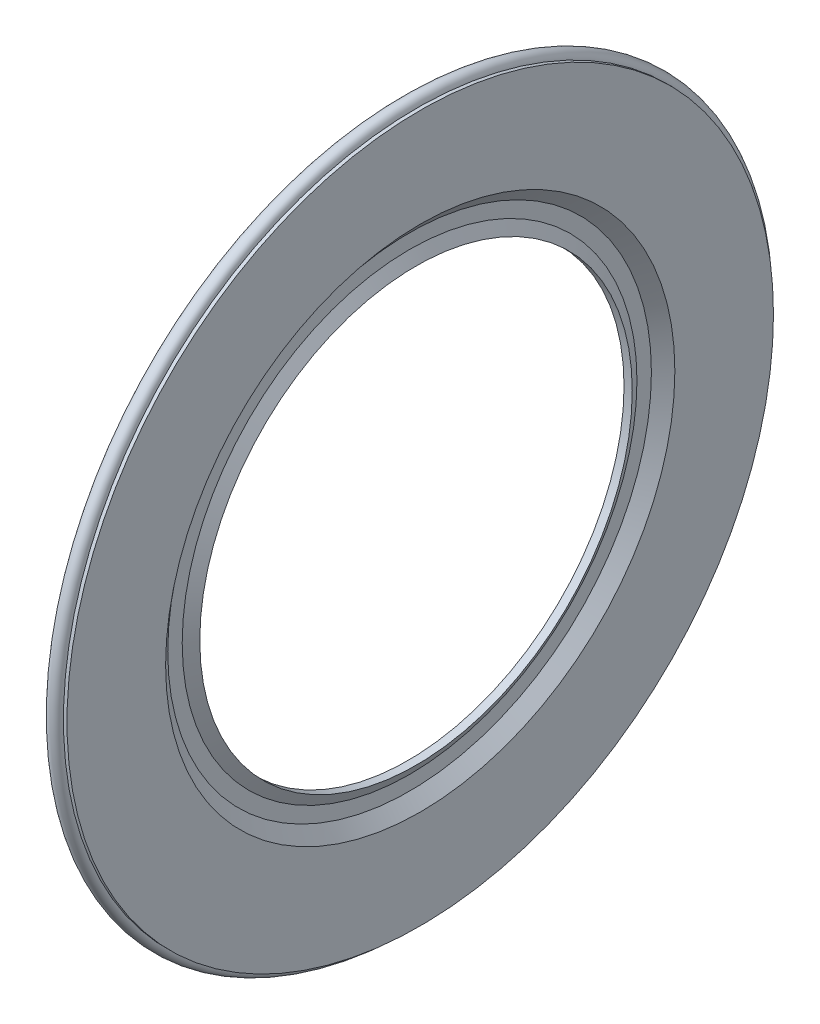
ISO-10303-21;
HEADER;
FILE_DESCRIPTION(('STEP AP214'),'2;1');
FILE_NAME('part.step','',(''),(''),'','','');
FILE_SCHEMA(('AUTOMOTIVE_DESIGN { 1 0 10303 214 1 1 1 1 }'));
ENDSEC;
DATA;
#1=APPLICATION_CONTEXT('core data for automotive mechanical design processes');
#2=APPLICATION_PROTOCOL_DEFINITION('international standard','automotive_design',2000,#1);
#3=PRODUCT_CONTEXT('',#1,'mechanical');
#4=PRODUCT('Part','Part','',(#3));
#5=PRODUCT_RELATED_PRODUCT_CATEGORY('part','',(#4));
#6=PRODUCT_DEFINITION_FORMATION('','',#4);
#7=PRODUCT_DEFINITION_CONTEXT('part definition',#1,'design');
#8=PRODUCT_DEFINITION('design','',#6,#7);
#9=PRODUCT_DEFINITION_SHAPE('','',#8);
#10=(LENGTH_UNIT() NAMED_UNIT(*) SI_UNIT(.MILLI.,.METRE.));
#11=(NAMED_UNIT(*) PLANE_ANGLE_UNIT() SI_UNIT($,.RADIAN.));
#12=(NAMED_UNIT(*) SI_UNIT($,.STERADIAN.) SOLID_ANGLE_UNIT());
#13=UNCERTAINTY_MEASURE_WITH_UNIT(LENGTH_MEASURE(1.E-05),#10,'distance_accuracy_value','');
#14=(GEOMETRIC_REPRESENTATION_CONTEXT(3) GLOBAL_UNCERTAINTY_ASSIGNED_CONTEXT((#13)) GLOBAL_UNIT_ASSIGNED_CONTEXT((#10,
#11,#12)) REPRESENTATION_CONTEXT('',''));
#15=CARTESIAN_POINT('',(0.,0.,0.));
#16=DIRECTION('',(0.,0.,1.));
#17=DIRECTION('',(1.,0.,0.));
#18=AXIS2_PLACEMENT_3D('',#15,#16,#17);
#19=CARTESIAN_POINT('',(5.5,0.,0.));
#20=DIRECTION('',(-1.,0.,0.));
#21=DIRECTION('',(0.,0.,1.));
#22=AXIS2_PLACEMENT_3D('',#19,#20,#21);
#23=CONICAL_SURFACE('',#22,6.34641016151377,1.0471975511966);
#24=CARTESIAN_POINT('',(5.6501110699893,0.,0.));
#25=DIRECTION('',(1.,0.,0.));
#26=DIRECTION('',(0.,0.,-1.));
#27=AXIS2_PLACEMENT_3D('',#24,#25,#26);
#28=CIRCLE('',#27,6.08641016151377);
#29=CARTESIAN_POINT('',(5.6501110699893,0.,-6.08641016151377));
#30=VERTEX_POINT('',#29);
#31=EDGE_CURVE('E76',#30,#30,#28,.T.);
#32=ORIENTED_EDGE('',*,*,#31,.T.);
#33=EDGE_LOOP('',(#32));
#34=FACE_BOUND('',#33,.T.);
#35=CARTESIAN_POINT('',(5.5,0.,0.));
#36=DIRECTION('',(1.,0.,0.));
#37=DIRECTION('',(0.,0.,-1.));
#38=AXIS2_PLACEMENT_3D('',#35,#36,#37);
#39=CIRCLE('',#38,6.34641016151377);
#40=CARTESIAN_POINT('',(5.5,0.,-6.34641016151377));
#41=VERTEX_POINT('',#40);
#42=EDGE_CURVE('E10',#41,#41,#39,.T.);
#43=ORIENTED_EDGE('',*,*,#42,.F.);
#44=EDGE_LOOP('',(#43));
#45=FACE_BOUND('',#44,.T.);
#46=ADVANCED_FACE('F15',(#34,#45),#23,.F.);
#47=CARTESIAN_POINT('',(5.5,7.16,0.));
#48=DIRECTION('',(-1.,0.,0.));
#49=DIRECTION('',(0.,0.,1.));
#50=AXIS2_PLACEMENT_3D('',#47,#48,#49);
#51=PLANE('',#50);
#52=ORIENTED_EDGE('',*,*,#42,.T.);
#53=EDGE_LOOP('',(#52));
#54=FACE_BOUND('',#53,.T.);
#55=CARTESIAN_POINT('',(5.5,0.,0.));
#56=DIRECTION('',(1.,0.,0.));
#57=DIRECTION('',(0.,0.,-1.));
#58=AXIS2_PLACEMENT_3D('',#55,#56,#57);
#59=CIRCLE('',#58,7.16);
#60=CARTESIAN_POINT('',(5.5,0.,-7.16));
#61=VERTEX_POINT('',#60);
#62=EDGE_CURVE('E22',#61,#61,#59,.T.);
#63=ORIENTED_EDGE('',*,*,#62,.F.);
#64=EDGE_LOOP('',(#63));
#65=FACE_BOUND('',#64,.T.);
#66=ADVANCED_FACE('F97',(#54,#65),#51,.T.);
#67=CARTESIAN_POINT('',(5.5,0.,0.));
#68=DIRECTION('',(1.,0.,0.));
#69=DIRECTION('',(0.,0.,-1.));
#70=AXIS2_PLACEMENT_3D('',#67,#68,#69);
#71=CONICAL_SURFACE('',#70,7.16,0.876058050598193);
#72=CARTESIAN_POINT('',(5.6,0.,0.));
#73=DIRECTION('',(1.,0.,0.));
#74=DIRECTION('',(0.,0.,-1.));
#75=AXIS2_PLACEMENT_3D('',#72,#73,#74);
#76=CIRCLE('',#75,7.28);
#77=CARTESIAN_POINT('',(5.6,0.,-7.28));
#78=VERTEX_POINT('',#77);
#79=EDGE_CURVE('E31',#78,#78,#76,.T.);
#80=ORIENTED_EDGE('',*,*,#79,.F.);
#81=EDGE_LOOP('',(#80));
#82=FACE_BOUND('',#81,.T.);
#83=ORIENTED_EDGE('',*,*,#62,.T.);
#84=EDGE_LOOP('',(#83));
#85=FACE_BOUND('',#84,.T.);
#86=ADVANCED_FACE('F101',(#82,#85),#71,.T.);
#87=CARTESIAN_POINT('',(5.6,7.28,0.));
#88=DIRECTION('',(1.,0.,0.));
#89=DIRECTION('',(0.,0.,-1.));
#90=AXIS2_PLACEMENT_3D('',#87,#88,#89);
#91=PLANE('',#90);
#92=CARTESIAN_POINT('',(5.6,0.,0.));
#93=DIRECTION('',(1.,0.,0.));
#94=DIRECTION('',(0.,0.,-1.));
#95=AXIS2_PLACEMENT_3D('',#92,#93,#94);
#96=CIRCLE('',#95,8.72);
#97=CARTESIAN_POINT('',(5.6,0.,-8.72));
#98=VERTEX_POINT('',#97);
#99=EDGE_CURVE('E38',#98,#98,#96,.T.);
#100=ORIENTED_EDGE('',*,*,#99,.F.);
#101=EDGE_LOOP('',(#100));
#102=FACE_BOUND('',#101,.T.);
#103=ORIENTED_EDGE('',*,*,#79,.T.);
#104=EDGE_LOOP('',(#103));
#105=FACE_BOUND('',#104,.T.);
#106=ADVANCED_FACE('F105',(#102,#105),#91,.F.);
#107=CARTESIAN_POINT('',(5.6,0.,0.));
#108=DIRECTION('',(-1.,0.,0.));
#109=DIRECTION('',(0.,0.,1.));
#110=AXIS2_PLACEMENT_3D('',#107,#108,#109);
#111=CONICAL_SURFACE('',#110,8.72,0.876058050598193);
#112=CARTESIAN_POINT('',(5.5,0.,0.));
#113=DIRECTION('',(1.,0.,0.));
#114=DIRECTION('',(0.,0.,-1.));
#115=AXIS2_PLACEMENT_3D('',#112,#113,#114);
#116=CIRCLE('',#115,8.84);
#117=CARTESIAN_POINT('',(5.5,0.,-8.84));
#118=VERTEX_POINT('',#117);
#119=EDGE_CURVE('E44',#118,#118,#116,.T.);
#120=ORIENTED_EDGE('',*,*,#119,.F.);
#121=EDGE_LOOP('',(#120));
#122=FACE_BOUND('',#121,.T.);
#123=ORIENTED_EDGE('',*,*,#99,.T.);
#124=EDGE_LOOP('',(#123));
#125=FACE_BOUND('',#124,.T.);
#126=ADVANCED_FACE('F112',(#122,#125),#111,.F.);
#127=CARTESIAN_POINT('',(5.5,9.94226497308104,0.));
#128=DIRECTION('',(-1.,0.,0.));
#129=DIRECTION('',(0.,0.,1.));
#130=AXIS2_PLACEMENT_3D('',#127,#128,#129);
#131=PLANE('',#130);
#132=ORIENTED_EDGE('',*,*,#119,.T.);
#133=EDGE_LOOP('',(#132));
#134=FACE_BOUND('',#133,.T.);
#135=CARTESIAN_POINT('',(5.5,0.,0.));
#136=DIRECTION('',(1.,0.,0.));
#137=DIRECTION('',(0.,0.,-1.));
#138=AXIS2_PLACEMENT_3D('',#135,#136,#137);
#139=CIRCLE('',#138,9.94226497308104);
#140=CARTESIAN_POINT('',(5.5,0.,-9.94226497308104));
#141=VERTEX_POINT('',#140);
#142=EDGE_CURVE('E48',#141,#141,#139,.T.);
#143=ORIENTED_EDGE('',*,*,#142,.F.);
#144=EDGE_LOOP('',(#143));
#145=FACE_BOUND('',#144,.T.);
#146=ADVANCED_FACE('F116',(#134,#145),#131,.T.);
#147=CARTESIAN_POINT('',(5.7,0.,0.));
#148=DIRECTION('',(1.,0.,0.));
#149=DIRECTION('',(0.,0.,-1.));
#150=AXIS2_PLACEMENT_3D('',#147,#148,#149);
#151=TOROIDAL_SURFACE('',#150,9.94226497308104,0.2);
#152=CARTESIAN_POINT('',(5.9,0.,0.));
#153=DIRECTION('',(1.,0.,0.));
#154=DIRECTION('',(0.,0.,-1.));
#155=AXIS2_PLACEMENT_3D('',#152,#153,#154);
#156=CIRCLE('',#155,9.94226497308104);
#157=CARTESIAN_POINT('',(5.9,0.,-9.94226497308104));
#158=VERTEX_POINT('',#157);
#159=EDGE_CURVE('E52',#158,#158,#156,.T.);
#160=ORIENTED_EDGE('',*,*,#159,.F.);
#161=EDGE_LOOP('',(#160));
#162=FACE_BOUND('',#161,.T.);
#163=ORIENTED_EDGE('',*,*,#142,.T.);
#164=EDGE_LOOP('',(#163));
#165=FACE_BOUND('',#164,.T.);
#166=ADVANCED_FACE('F120',(#162,#165),#151,.T.);
#167=CARTESIAN_POINT('',(6.,0.,0.));
#168=DIRECTION('',(1.,0.,0.));
#169=DIRECTION('',(0.,0.,-1.));
#170=AXIS2_PLACEMENT_3D('',#167,#168,#169);
#171=CYLINDRICAL_SURFACE('',#170,9.94226497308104);
#172=CARTESIAN_POINT('',(6.,0.,0.));
#173=DIRECTION('',(1.,0.,0.));
#174=DIRECTION('',(0.,0.,-1.));
#175=AXIS2_PLACEMENT_3D('',#172,#173,#174);
#176=CIRCLE('',#175,9.94226497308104);
#177=CARTESIAN_POINT('',(6.,0.,-9.94226497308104));
#178=VERTEX_POINT('',#177);
#179=EDGE_CURVE('E56',#178,#178,#176,.T.);
#180=ORIENTED_EDGE('',*,*,#179,.F.);
#181=EDGE_LOOP('',(#180));
#182=FACE_BOUND('',#181,.T.);
#183=ORIENTED_EDGE('',*,*,#159,.T.);
#184=EDGE_LOOP('',(#183));
#185=FACE_BOUND('',#184,.T.);
#186=ADVANCED_FACE('F124',(#182,#185),#171,.T.);
#187=CARTESIAN_POINT('',(6.,9.94226497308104,0.));
#188=DIRECTION('',(-1.,0.,0.));
#189=DIRECTION('',(0.,0.,1.));
#190=AXIS2_PLACEMENT_3D('',#187,#188,#189);
#191=PLANE('',#190);
#192=CARTESIAN_POINT('',(6.,0.,0.));
#193=DIRECTION('',(1.,0.,0.));
#194=DIRECTION('',(0.,0.,-1.));
#195=AXIS2_PLACEMENT_3D('',#192,#193,#194);
#196=CIRCLE('',#195,7.16679491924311);
#197=CARTESIAN_POINT('',(6.,0.,-7.16679491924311));
#198=VERTEX_POINT('',#197);
#199=EDGE_CURVE('E60',#198,#198,#196,.T.);
#200=ORIENTED_EDGE('',*,*,#199,.F.);
#201=EDGE_LOOP('',(#200));
#202=FACE_BOUND('',#201,.T.);
#203=ORIENTED_EDGE('',*,*,#179,.T.);
#204=EDGE_LOOP('',(#203));
#205=FACE_BOUND('',#204,.T.);
#206=ADVANCED_FACE('F128',(#202,#205),#191,.F.);
#207=CARTESIAN_POINT('',(6.,0.,0.));
#208=DIRECTION('',(1.,0.,0.));
#209=DIRECTION('',(0.,0.,-1.));
#210=AXIS2_PLACEMENT_3D('',#207,#208,#209);
#211=CONICAL_SURFACE('',#210,7.16679491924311,0.876058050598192);
#212=CARTESIAN_POINT('',(5.7,0.,0.));
#213=DIRECTION('',(1.,0.,0.));
#214=DIRECTION('',(0.,0.,-1.));
#215=AXIS2_PLACEMENT_3D('',#212,#213,#214);
#216=CIRCLE('',#215,6.80679491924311);
#217=CARTESIAN_POINT('',(5.7,0.,-6.80679491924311));
#218=VERTEX_POINT('',#217);
#219=EDGE_CURVE('E64',#218,#218,#216,.T.);
#220=ORIENTED_EDGE('',*,*,#219,.F.);
#221=EDGE_LOOP('',(#220));
#222=FACE_BOUND('',#221,.T.);
#223=ORIENTED_EDGE('',*,*,#199,.T.);
#224=EDGE_LOOP('',(#223));
#225=FACE_BOUND('',#224,.T.);
#226=ADVANCED_FACE('F132',(#222,#225),#211,.F.);
#227=CARTESIAN_POINT('',(5.7,6.4,0.));
#228=DIRECTION('',(1.,0.,0.));
#229=DIRECTION('',(0.,0.,-1.));
#230=AXIS2_PLACEMENT_3D('',#227,#228,#229);
#231=PLANE('',#230);
#232=ORIENTED_EDGE('',*,*,#219,.T.);
#233=EDGE_LOOP('',(#232));
#234=FACE_BOUND('',#233,.T.);
#235=CARTESIAN_POINT('',(5.7,0.,0.));
#236=DIRECTION('',(1.,0.,0.));
#237=DIRECTION('',(0.,0.,-1.));
#238=AXIS2_PLACEMENT_3D('',#235,#236,#237);
#239=CIRCLE('',#238,6.4);
#240=CARTESIAN_POINT('',(5.7,0.,-6.4));
#241=VERTEX_POINT('',#240);
#242=EDGE_CURVE('E68',#241,#241,#239,.T.);
#243=ORIENTED_EDGE('',*,*,#242,.F.);
#244=EDGE_LOOP('',(#243));
#245=FACE_BOUND('',#244,.T.);
#246=ADVANCED_FACE('F93',(#234,#245),#231,.T.);
#247=CARTESIAN_POINT('',(5.88105117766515,0.,0.));
#248=DIRECTION('',(-1.,0.,0.));
#249=DIRECTION('',(0.,0.,1.));
#250=AXIS2_PLACEMENT_3D('',#247,#248,#249);
#251=CONICAL_SURFACE('',#250,6.08641016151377,1.0471975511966);
#252=ORIENTED_EDGE('',*,*,#242,.T.);
#253=EDGE_LOOP('',(#252));
#254=FACE_BOUND('',#253,.T.);
#255=CARTESIAN_POINT('',(5.88105117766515,0.,0.));
#256=DIRECTION('',(1.,0.,0.));
#257=DIRECTION('',(0.,0.,-1.));
#258=AXIS2_PLACEMENT_3D('',#255,#256,#257);
#259=CIRCLE('',#258,6.08641016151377);
#260=CARTESIAN_POINT('',(5.88105117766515,0.,-6.08641016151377));
#261=VERTEX_POINT('',#260);
#262=EDGE_CURVE('E72',#261,#261,#259,.T.);
#263=ORIENTED_EDGE('',*,*,#262,.F.);
#264=EDGE_LOOP('',(#263));
#265=FACE_BOUND('',#264,.T.);
#266=ADVANCED_FACE('F86',(#254,#265),#251,.T.);
#267=CARTESIAN_POINT('',(6.,0.,0.));
#268=DIRECTION('',(1.,0.,0.));
#269=DIRECTION('',(0.,0.,-1.));
#270=AXIS2_PLACEMENT_3D('',#267,#268,#269);
#271=CYLINDRICAL_SURFACE('',#270,6.08641016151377);
#272=ORIENTED_EDGE('',*,*,#262,.T.);
#273=EDGE_LOOP('',(#272));
#274=FACE_BOUND('',#273,.T.);
#275=ORIENTED_EDGE('',*,*,#31,.F.);
#276=EDGE_LOOP('',(#275));
#277=FACE_BOUND('',#276,.T.);
#278=ADVANCED_FACE('F84',(#274,#277),#271,.F.);
#279=CLOSED_SHELL('',(#46,#66,#86,#106,#126,#146,#166,#186,#206,#226,#246,#266,#278));
#280=MANIFOLD_SOLID_BREP('B1',#279);
#281=ADVANCED_BREP_SHAPE_REPRESENTATION('',(#18,#280),#14);
#282=SHAPE_DEFINITION_REPRESENTATION(#9,#281);
ENDSEC;
END-ISO-10303-21;
